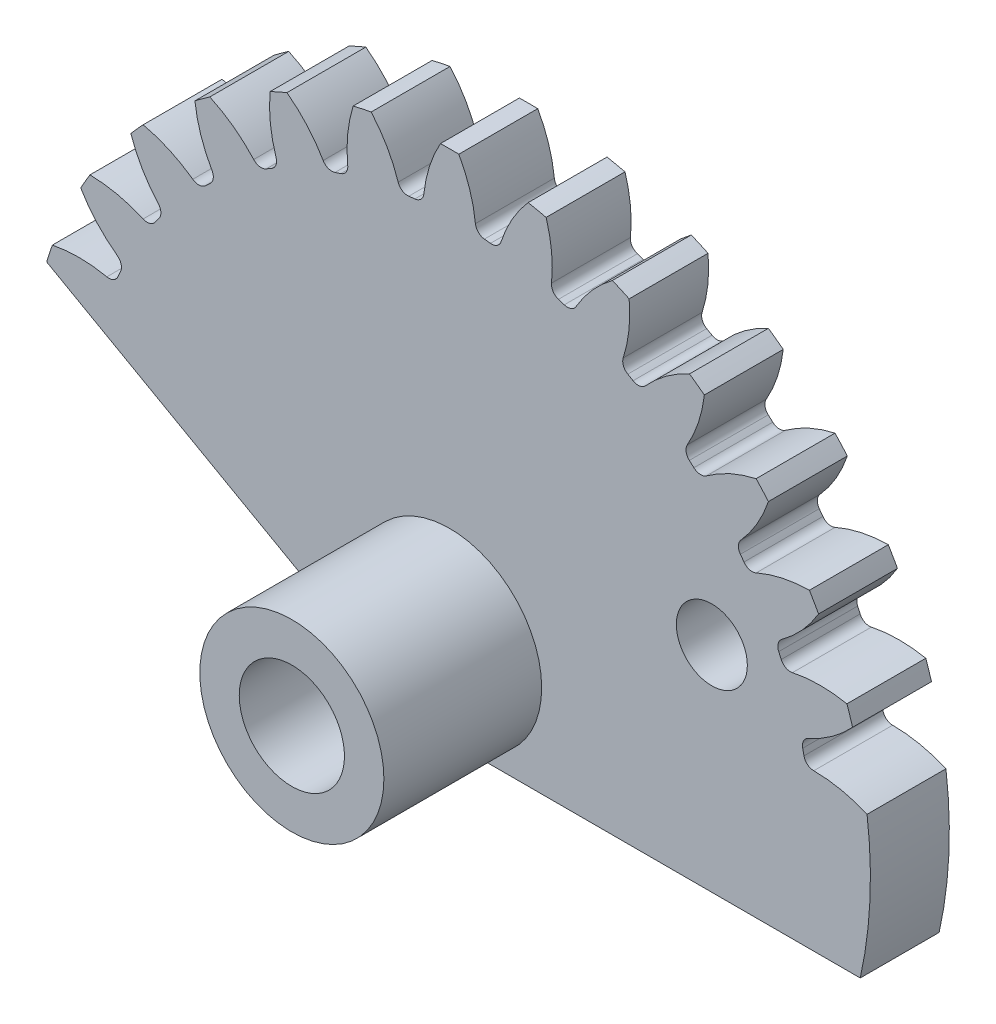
from build123d import *

# Parameters (mm, degrees)
BASE_DENTURE_DEPTH      = 3
DENTURE_COUNT           = 30
ESQUISSE3_R             = 2
PER_AGE_DEPTH           = 23.786970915
TAILLAGE_SECTEUR_REACH  = 24.787
EXTRUSION1_START        = -3
EXTRUSION1_DEPTH        = 3
ESQUISSE6_R             = 3.5
ESQUISSE6_R_2           = 2
EXTRUSION2_DEPTH        = 6
ENL_V_MAT_EXTRU_2_REACH = 25.409
ESQUISSE7_R             = 1.35


with BuildPart() as part:
    # D_veloppante → Base denture (new body)
    with BuildSketch(Plane.XY):
        with BuildLine():
            Line((1.43726637, 13.674676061), (0, 0))
            Line((0, 0), (-1.43726637, 13.674676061))
            ThreePointArc((-1.43726637, 13.674676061), (-1.379453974, 13.680628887), (-1.321616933, 13.6863373))
            ThreePointArc((-1.321616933, 13.6863373), (-1.090802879, 13.794522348), (-0.980289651, 14.024230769))
            ThreePointArc((-0.980289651, 14.024230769), (-0.765452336, 15.042350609), (-0.349601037, 15.996180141))
            ThreePointArc((-0.349601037, 15.996180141), (0, 16), (0.349601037, 15.996180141))
            ThreePointArc((0.349601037, 15.996180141), (0.765452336, 15.042350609), (0.980289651, 14.024230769))
            ThreePointArc((0.980289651, 14.024230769), (1.090802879, 13.794522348), (1.321616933, 13.6863373))
            ThreePointArc((1.321616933, 13.6863373), (1.379453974, 13.680628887), (1.43726637, 13.674676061))
        make_face()
    base_denture = extrude(amount=BASE_DENTURE_DEPTH)

    # Denture: Base denture ×30 about axis
    denture_axis = Axis((0, 0, 0), (0, 0, 1))
    for i in range(1, DENTURE_COUNT):
        add(base_denture.rotate(denture_axis, i * 360 / DENTURE_COUNT))

    # Esquisse3 → Per_age (cut, through all)
    with BuildSketch(Plane.XY):
        Circle(ESQUISSE3_R)
    extrude(amount=PER_AGE_DEPTH, mode=Mode.SUBTRACT)

    # Esquisse4 → Taillage secteur (cut, up to next)
    with BuildSketch(Plane.XY.offset(3), mode=Mode.PRIVATE) as taillage_secteur_sk1:
        with BuildLine():
            Line((-15.321304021, 4.610601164), (-1.717290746, -3.049739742))
            ThreePointArc((-1.717290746, -3.049739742), (-0.887668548, -3.38556414), (0, -3.5))
            Line((0, -3.5), (15.612494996, -3.5))
            ThreePointArc((15.612494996, -3.5), (-4.057913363, -15.476864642), (-15.321304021, 4.610601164))
        make_face()
    taillage_secteur_tool1 = extrude(taillage_secteur_sk1.sketch, amount=-TAILLAGE_SECTEUR_REACH, mode=Mode.PRIVATE) & part.part
    add(taillage_secteur_tool1.solids().sort_by_distance((-1.91578, -7.306777, 3))[0], mode=Mode.SUBTRACT)

    # Esquisse5 → Extrusion1 (add)
    with BuildSketch(Plane.XY.offset(3).offset(EXTRUSION1_START)):
        with BuildLine():
            Line((15.872008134, 2.019742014), (2, 0))
            ThreePointArc((2, 0), (1.414213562, -1.414213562), (0, -2))
            Line((0, -2), (0, -3.5))
            Line((0, -3.5), (15.612494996, -3.5))
            ThreePointArc((15.612494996, -3.5), (15.982345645, -0.751417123), (15.872008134, 2.019742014))
        make_face()
    extrude(amount=EXTRUSION1_DEPTH)

    # Esquisse6 → Extrusion2 (add)
    with BuildSketch(Plane.XY.offset(3)):
        Circle(ESQUISSE6_R)
        Circle(ESQUISSE6_R_2, mode=Mode.SUBTRACT)
    extrude(amount=EXTRUSION2_DEPTH)

    # Esquisse7 → Enl_v. mat.-Extru.2 (cut, up to next)
    with BuildSketch(Plane.XY.offset(3), mode=Mode.PRIVATE) as enl_v_mat_extru_2_sk1:
        with Locations((9.969385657, 4.648800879)):
            Circle(ESQUISSE7_R)
    enl_v_mat_extru_2_tool1 = extrude(enl_v_mat_extru_2_sk1.sketch, amount=-ENL_V_MAT_EXTRU_2_REACH, mode=Mode.PRIVATE) & part.part
    add(enl_v_mat_extru_2_tool1.solids().sort_by_distance((9.969386, 4.648801, 3))[0], mode=Mode.SUBTRACT)


solid = part.part
